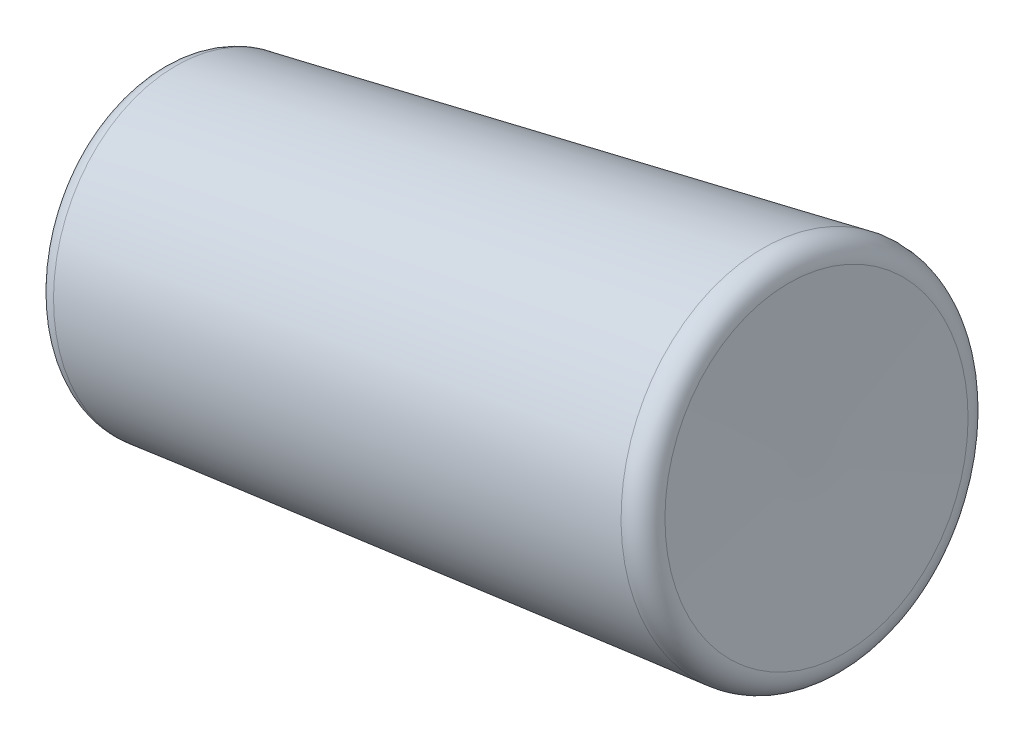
ISO-10303-21;
HEADER;
FILE_DESCRIPTION(('STEP AP214'),'2;1');
FILE_NAME('part.step','',(''),(''),'','','');
FILE_SCHEMA(('AUTOMOTIVE_DESIGN { 1 0 10303 214 1 1 1 1 }'));
ENDSEC;
DATA;
#1=APPLICATION_CONTEXT('core data for automotive mechanical design processes');
#2=APPLICATION_PROTOCOL_DEFINITION('international standard','automotive_design',2000,#1);
#3=PRODUCT_CONTEXT('',#1,'mechanical');
#4=PRODUCT('Part','Part','',(#3));
#5=PRODUCT_RELATED_PRODUCT_CATEGORY('part','',(#4));
#6=PRODUCT_DEFINITION_FORMATION('','',#4);
#7=PRODUCT_DEFINITION_CONTEXT('part definition',#1,'design');
#8=PRODUCT_DEFINITION('design','',#6,#7);
#9=PRODUCT_DEFINITION_SHAPE('','',#8);
#10=(LENGTH_UNIT() NAMED_UNIT(*) SI_UNIT(.MILLI.,.METRE.));
#11=(NAMED_UNIT(*) PLANE_ANGLE_UNIT() SI_UNIT($,.RADIAN.));
#12=(NAMED_UNIT(*) SI_UNIT($,.STERADIAN.) SOLID_ANGLE_UNIT());
#13=UNCERTAINTY_MEASURE_WITH_UNIT(LENGTH_MEASURE(1.E-05),#10,'distance_accuracy_value','');
#14=(GEOMETRIC_REPRESENTATION_CONTEXT(3) GLOBAL_UNCERTAINTY_ASSIGNED_CONTEXT((#13)) GLOBAL_UNIT_ASSIGNED_CONTEXT((#10,
#11,#12)) REPRESENTATION_CONTEXT('',''));
#15=CARTESIAN_POINT('',(0.,0.,0.));
#16=DIRECTION('',(0.,0.,1.));
#17=DIRECTION('',(1.,0.,0.));
#18=AXIS2_PLACEMENT_3D('',#15,#16,#17);
#19=CARTESIAN_POINT('',(3.55408135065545,19.466145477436,0.));
#20=DIRECTION('',(0.982394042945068,0.186820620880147,0.));
#21=DIRECTION('',(-0.186820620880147,0.982394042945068,0.));
#22=AXIS2_PLACEMENT_3D('',#19,#20,#21);
#23=CONICAL_SURFACE('',#22,4.06240633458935,0.0389680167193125);
#24=CARTESIAN_POINT('',(3.02343228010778,19.3652326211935,0.));
#25=DIRECTION('',(-0.982394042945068,-0.186820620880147,0.));
#26=DIRECTION('',(0.186820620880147,-0.982394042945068,0.));
#27=AXIS2_PLACEMENT_3D('',#24,#25,#26);
#28=CIRCLE('',#27,4.04134674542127);
#29=CARTESIAN_POINT('',(3.77843918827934,15.3950376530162,0.));
#30=VERTEX_POINT('',#29);
#31=EDGE_CURVE('E65',#30,#30,#28,.T.);
#32=ORIENTED_EDGE('',*,*,#31,.T.);
#33=EDGE_LOOP('',(#32));
#34=FACE_BOUND('',#33,.T.);
#35=CARTESIAN_POINT('',(-10.9596541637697,16.7060869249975,0.));
#36=DIRECTION('',(-0.982394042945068,-0.186820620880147,0.));
#37=DIRECTION('',(0.186820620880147,-0.982394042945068,0.));
#38=AXIS2_PLACEMENT_3D('',#35,#36,#37);
#39=CIRCLE('',#38,3.48640738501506);
#40=CARTESIAN_POINT('',(-10.30832137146,13.281061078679,0.));
#41=VERTEX_POINT('',#40);
#42=EDGE_CURVE('E68',#41,#41,#39,.F.);
#43=ORIENTED_EDGE('',*,*,#42,.T.);
#44=EDGE_LOOP('',(#43));
#45=FACE_BOUND('',#44,.T.);
#46=ADVANCED_FACE('F31',(#34,#45),#23,.T.);
#47=CARTESIAN_POINT('',(3.39848575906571,19.4365560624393,0.));
#48=DIRECTION('',(0.982394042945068,0.186820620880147,0.));
#49=DIRECTION('',(-0.186820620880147,0.982394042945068,0.));
#50=AXIS2_PLACEMENT_3D('',#47,#48,#49);
#51=CONICAL_SURFACE('',#50,0.,1.53182831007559);
#52=CARTESIAN_POINT('',(3.53339253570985,19.4622111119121,0.));
#53=DIRECTION('',(-0.982394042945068,-0.186820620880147,0.));
#54=DIRECTION('',(0.186820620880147,-0.982394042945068,0.));
#55=AXIS2_PLACEMENT_3D('',#52,#53,#54);
#56=CIRCLE('',#55,3.52224724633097);
#57=CARTESIAN_POINT('',(4.19142095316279,16.0019763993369,0.));
#58=VERTEX_POINT('',#57);
#59=EDGE_CURVE('E38',#58,#58,#56,.F.);
#60=ORIENTED_EDGE('',*,*,#59,.T.);
#61=EDGE_LOOP('',(#60));
#62=FACE_BOUND('',#61,.T.);
#63=CARTESIAN_POINT('',(3.39848575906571,19.4365560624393,0.));
#64=VERTEX_POINT('',#63);
#65=VERTEX_LOOP('',#64);
#66=FACE_BOUND('',#65,.T.);
#67=ADVANCED_FACE('F47',(#62,#66),#51,.F.);
#68=CARTESIAN_POINT('',(-11.4136421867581,16.6197526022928,0.));
#69=DIRECTION('',(0.982394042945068,0.186820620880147,0.));
#70=DIRECTION('',(-0.186820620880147,0.982394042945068,0.));
#71=AXIS2_PLACEMENT_3D('',#68,#69,#70);
#72=CONICAL_SURFACE('',#71,3.46839020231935,1.53182831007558);
#73=CARTESIAN_POINT('',(-11.431342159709,16.6163866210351,0.));
#74=DIRECTION('',(-0.982394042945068,-0.186820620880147,0.));
#75=DIRECTION('',(0.186820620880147,-0.982394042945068,0.));
#76=AXIS2_PLACEMENT_3D('',#73,#74,#75);
#77=CIRCLE('',#76,3.00626604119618);
#78=CARTESIAN_POINT('',(-10.8697096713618,13.6630487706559,0.));
#79=VERTEX_POINT('',#78);
#80=EDGE_CURVE('E11',#79,#79,#77,.T.);
#81=ORIENTED_EDGE('',*,*,#80,.T.);
#82=EDGE_LOOP('',(#81));
#83=FACE_BOUND('',#82,.T.);
#84=CARTESIAN_POINT('',(-11.5464861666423,16.5944898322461,0.));
#85=VERTEX_POINT('',#84);
#86=VERTEX_LOOP('',#85);
#87=FACE_BOUND('',#86,.T.);
#88=ADVANCED_FACE('F44',(#83,#87),#72,.T.);
#89=CARTESIAN_POINT('',(3.04256840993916,19.3688717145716,0.));
#90=DIRECTION('',(0.982394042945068,0.186820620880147,0.));
#91=DIRECTION('',(-0.186820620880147,0.982394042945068,0.));
#92=AXIS2_PLACEMENT_3D('',#89,#90,#91);
#93=TOROIDAL_SURFACE('',#92,3.54172632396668,0.5);
#94=ORIENTED_EDGE('',*,*,#59,.F.);
#95=EDGE_LOOP('',(#94));
#96=FACE_BOUND('',#95,.T.);
#97=ORIENTED_EDGE('',*,*,#31,.F.);
#98=EDGE_LOOP('',(#97));
#99=FACE_BOUND('',#98,.T.);
#100=ADVANCED_FACE('F46',(#96,#99),#93,.T.);
#101=CARTESIAN_POINT('',(-10.9405180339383,16.7097260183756,0.));
#102=DIRECTION('',(0.982394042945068,0.186820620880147,0.));
#103=DIRECTION('',(-0.186820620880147,0.982394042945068,0.));
#104=AXIS2_PLACEMENT_3D('',#101,#102,#103);
#105=TOROIDAL_SURFACE('',#104,2.98678696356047,0.5);
#106=ORIENTED_EDGE('',*,*,#42,.F.);
#107=EDGE_LOOP('',(#106));
#108=FACE_BOUND('',#107,.T.);
#109=ORIENTED_EDGE('',*,*,#80,.F.);
#110=EDGE_LOOP('',(#109));
#111=FACE_BOUND('',#110,.T.);
#112=ADVANCED_FACE('F54',(#108,#111),#105,.T.);
#113=CLOSED_SHELL('',(#46,#67,#88,#100,#112));
#114=MANIFOLD_SOLID_BREP('B2',#113);
#115=ADVANCED_BREP_SHAPE_REPRESENTATION('',(#18,#114),#14);
#116=SHAPE_DEFINITION_REPRESENTATION(#9,#115);
ENDSEC;
END-ISO-10303-21;
